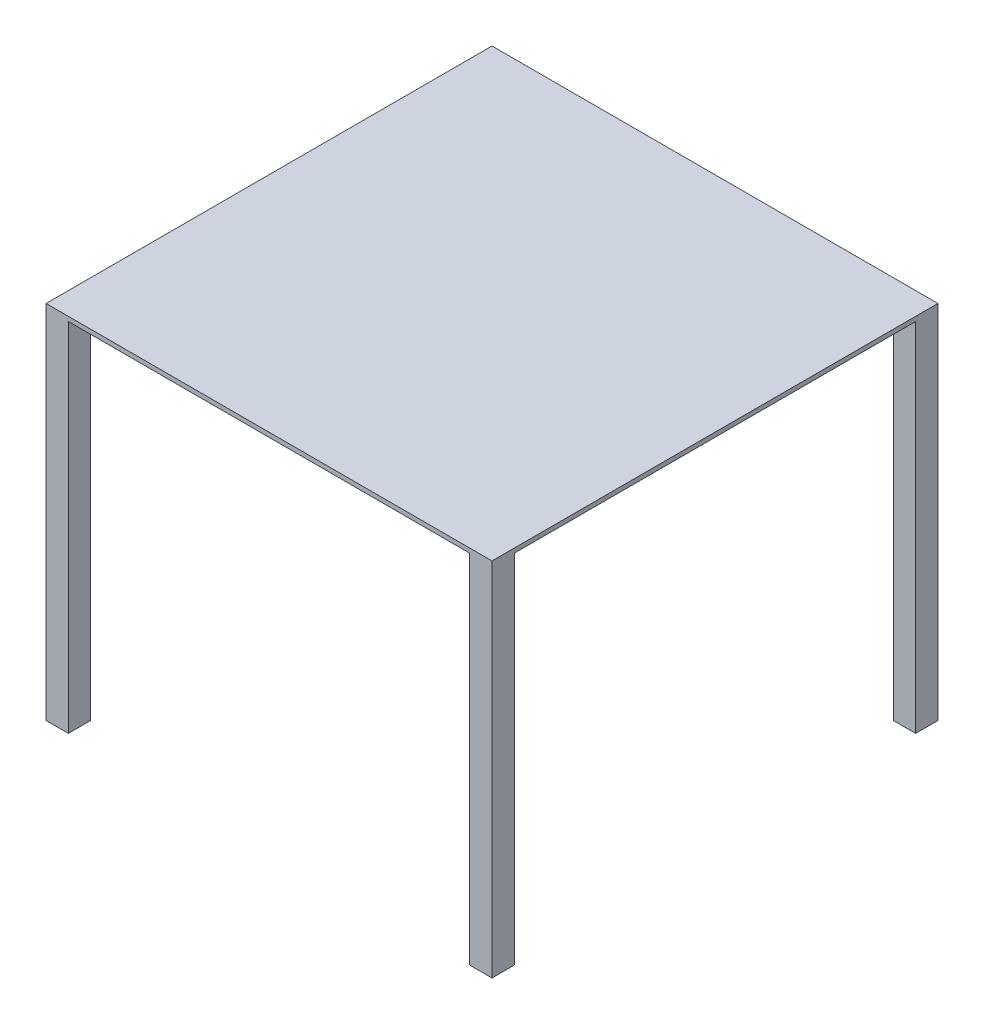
ISO-10303-21;
HEADER;
FILE_DESCRIPTION(('STEP AP214'),'2;1');
FILE_NAME('part.step','',(''),(''),'','','');
FILE_SCHEMA(('AUTOMOTIVE_DESIGN { 1 0 10303 214 1 1 1 1 }'));
ENDSEC;
DATA;
#1=APPLICATION_CONTEXT('core data for automotive mechanical design processes');
#2=APPLICATION_PROTOCOL_DEFINITION('international standard','automotive_design',2000,#1);
#3=PRODUCT_CONTEXT('',#1,'mechanical');
#4=PRODUCT('Part','Part','',(#3));
#5=PRODUCT_RELATED_PRODUCT_CATEGORY('part','',(#4));
#6=PRODUCT_DEFINITION_FORMATION('','',#4);
#7=PRODUCT_DEFINITION_CONTEXT('part definition',#1,'design');
#8=PRODUCT_DEFINITION('design','',#6,#7);
#9=PRODUCT_DEFINITION_SHAPE('','',#8);
#10=(LENGTH_UNIT() NAMED_UNIT(*) SI_UNIT(.MILLI.,.METRE.));
#11=(NAMED_UNIT(*) PLANE_ANGLE_UNIT() SI_UNIT($,.RADIAN.));
#12=(NAMED_UNIT(*) SI_UNIT($,.STERADIAN.) SOLID_ANGLE_UNIT());
#13=UNCERTAINTY_MEASURE_WITH_UNIT(LENGTH_MEASURE(1.E-05),#10,'distance_accuracy_value','');
#14=(GEOMETRIC_REPRESENTATION_CONTEXT(3) GLOBAL_UNCERTAINTY_ASSIGNED_CONTEXT((#13)) GLOBAL_UNIT_ASSIGNED_CONTEXT((#10,
#11,#12)) REPRESENTATION_CONTEXT('',''));
#15=CARTESIAN_POINT('',(0.,0.,0.));
#16=DIRECTION('',(0.,0.,1.));
#17=DIRECTION('',(1.,0.,0.));
#18=AXIS2_PLACEMENT_3D('',#15,#16,#17);
#19=CARTESIAN_POINT('',(-125.502845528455,-11.4093495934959,1000.));
#20=DIRECTION('',(0.,1.,0.));
#21=DIRECTION('',(0.,0.,1.));
#22=AXIS2_PLACEMENT_3D('',#19,#20,#21);
#23=PLANE('',#22);
#24=DIRECTION('',(0.,0.,1.));
#25=VECTOR('',#24,1.);
#26=CARTESIAN_POINT('',(-75.5028455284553,-11.4093495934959,1000.));
#27=LINE('',#26,#25);
#28=CARTESIAN_POINT('',(-75.5028455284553,-11.4093495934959,950.));
#29=VERTEX_POINT('',#28);
#30=CARTESIAN_POINT('',(-75.5028455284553,-11.4093495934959,1000.));
#31=VERTEX_POINT('',#30);
#32=EDGE_CURVE('E42',#29,#31,#27,.T.);
#33=ORIENTED_EDGE('',*,*,#32,.F.);
#34=DIRECTION('',(1.,0.,0.));
#35=VECTOR('',#34,1.);
#36=CARTESIAN_POINT('',(-75.5028455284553,-11.4093495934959,950.));
#37=LINE('',#36,#35);
#38=CARTESIAN_POINT('',(-125.502845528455,-11.4093495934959,950.));
#39=VERTEX_POINT('',#38);
#40=EDGE_CURVE('E146',#39,#29,#37,.T.);
#41=ORIENTED_EDGE('',*,*,#40,.F.);
#42=DIRECTION('',(0.,0.,-1.));
#43=VECTOR('',#42,1.);
#44=CARTESIAN_POINT('',(-125.502845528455,-11.4093495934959,1000.));
#45=LINE('',#44,#43);
#46=CARTESIAN_POINT('',(-125.502845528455,-11.4093495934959,49.9999999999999));
#47=VERTEX_POINT('',#46);
#48=EDGE_CURVE('E11',#39,#47,#45,.T.);
#49=ORIENTED_EDGE('',*,*,#48,.T.);
#50=DIRECTION('',(-1.,0.,0.));
#51=VECTOR('',#50,1.);
#52=CARTESIAN_POINT('',(-75.5028455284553,-11.4093495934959,50.));
#53=LINE('',#52,#51);
#54=CARTESIAN_POINT('',(-75.5028455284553,-11.4093495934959,50.));
#55=VERTEX_POINT('',#54);
#56=EDGE_CURVE('E49',#55,#47,#53,.T.);
#57=ORIENTED_EDGE('',*,*,#56,.F.);
#58=DIRECTION('',(0.,0.,1.));
#59=VECTOR('',#58,1.);
#60=CARTESIAN_POINT('',(-75.5028455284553,-11.4093495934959,50.));
#61=LINE('',#60,#59);
#62=CARTESIAN_POINT('',(-75.5028455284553,-11.4093495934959,0.));
#63=VERTEX_POINT('',#62);
#64=EDGE_CURVE('E381',#63,#55,#61,.T.);
#65=ORIENTED_EDGE('',*,*,#64,.F.);
#66=DIRECTION('',(1.,0.,0.));
#67=VECTOR('',#66,1.);
#68=CARTESIAN_POINT('',(-125.502845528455,-11.4093495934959,0.));
#69=LINE('',#68,#67);
#70=CARTESIAN_POINT('',(824.497154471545,-11.4093495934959,0.));
#71=VERTEX_POINT('',#70);
#72=EDGE_CURVE('E232',#63,#71,#69,.T.);
#73=ORIENTED_EDGE('',*,*,#72,.T.);
#74=DIRECTION('',(0.,0.,-1.));
#75=VECTOR('',#74,1.);
#76=CARTESIAN_POINT('',(824.497154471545,-11.4093495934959,50.));
#77=LINE('',#76,#75);
#78=CARTESIAN_POINT('',(824.497154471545,-11.4093495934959,49.9999999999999));
#79=VERTEX_POINT('',#78);
#80=EDGE_CURVE('E176',#79,#71,#77,.T.);
#81=ORIENTED_EDGE('',*,*,#80,.F.);
#82=DIRECTION('',(-1.,0.,0.));
#83=VECTOR('',#82,1.);
#84=CARTESIAN_POINT('',(874.497154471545,-11.4093495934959,50.));
#85=LINE('',#84,#83);
#86=CARTESIAN_POINT('',(874.497154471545,-11.4093495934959,50.));
#87=VERTEX_POINT('',#86);
#88=EDGE_CURVE('E167',#87,#79,#85,.T.);
#89=ORIENTED_EDGE('',*,*,#88,.F.);
#90=DIRECTION('',(0.,0.,-1.));
#91=VECTOR('',#90,1.);
#92=CARTESIAN_POINT('',(874.497154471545,-11.4093495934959,1000.));
#93=LINE('',#92,#91);
#94=CARTESIAN_POINT('',(874.497154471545,-11.4093495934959,950.));
#95=VERTEX_POINT('',#94);
#96=EDGE_CURVE('E34',#95,#87,#93,.T.);
#97=ORIENTED_EDGE('',*,*,#96,.F.);
#98=DIRECTION('',(1.,0.,0.));
#99=VECTOR('',#98,1.);
#100=CARTESIAN_POINT('',(874.497154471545,-11.4093495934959,950.));
#101=LINE('',#100,#99);
#102=CARTESIAN_POINT('',(824.497154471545,-11.4093495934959,950.));
#103=VERTEX_POINT('',#102);
#104=EDGE_CURVE('E204',#103,#95,#101,.T.);
#105=ORIENTED_EDGE('',*,*,#104,.F.);
#106=DIRECTION('',(0.,0.,-1.));
#107=VECTOR('',#106,1.);
#108=CARTESIAN_POINT('',(824.497154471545,-11.4093495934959,1000.));
#109=LINE('',#108,#107);
#110=CARTESIAN_POINT('',(824.497154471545,-11.4093495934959,1000.));
#111=VERTEX_POINT('',#110);
#112=EDGE_CURVE('E198',#111,#103,#109,.T.);
#113=ORIENTED_EDGE('',*,*,#112,.F.);
#114=DIRECTION('',(1.,0.,0.));
#115=VECTOR('',#114,1.);
#116=CARTESIAN_POINT('',(-125.502845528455,-11.4093495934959,1000.));
#117=LINE('',#116,#115);
#118=EDGE_CURVE('E28',#31,#111,#117,.T.);
#119=ORIENTED_EDGE('',*,*,#118,.F.);
#120=EDGE_LOOP('',(#33,#41,#49,#57,#65,#73,#81,#89,#97,#105,#113,#119));
#121=FACE_BOUND('',#120,.T.);
#122=ADVANCED_FACE('F24',(#121),#23,.F.);
#123=CARTESIAN_POINT('',(-125.502845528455,-1.40934959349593,1000.));
#124=DIRECTION('',(1.,0.,0.));
#125=DIRECTION('',(0.,0.,-1.));
#126=AXIS2_PLACEMENT_3D('',#123,#124,#125);
#127=PLANE('',#126);
#128=DIRECTION('',(0.,-1.,0.));
#129=VECTOR('',#128,1.);
#130=CARTESIAN_POINT('',(-125.502845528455,-1.40934959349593,0.));
#131=LINE('',#130,#129);
#132=CARTESIAN_POINT('',(-125.502845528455,-1.40934959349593,0.));
#133=VERTEX_POINT('',#132);
#134=CARTESIAN_POINT('',(-125.502845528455,-811.409349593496,0.));
#135=VERTEX_POINT('',#134);
#136=EDGE_CURVE('E230',#133,#135,#131,.T.);
#137=ORIENTED_EDGE('',*,*,#136,.T.);
#138=DIRECTION('',(0.,0.,-1.));
#139=VECTOR('',#138,1.);
#140=CARTESIAN_POINT('',(-125.502845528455,-811.409349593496,50.));
#141=LINE('',#140,#139);
#142=CARTESIAN_POINT('',(-125.502845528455,-811.409349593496,50.));
#143=VERTEX_POINT('',#142);
#144=EDGE_CURVE('E162',#143,#135,#141,.T.);
#145=ORIENTED_EDGE('',*,*,#144,.F.);
#146=DIRECTION('',(0.,1.,0.));
#147=VECTOR('',#146,1.);
#148=CARTESIAN_POINT('',(-125.502845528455,-811.409349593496,50.));
#149=LINE('',#148,#147);
#150=EDGE_CURVE('E160',#143,#47,#149,.T.);
#151=ORIENTED_EDGE('',*,*,#150,.T.);
#152=ORIENTED_EDGE('',*,*,#48,.F.);
#153=DIRECTION('',(0.,1.,0.));
#154=VECTOR('',#153,1.);
#155=CARTESIAN_POINT('',(-125.502845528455,-811.409349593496,950.));
#156=LINE('',#155,#154);
#157=CARTESIAN_POINT('',(-125.502845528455,-811.409349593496,950.));
#158=VERTEX_POINT('',#157);
#159=EDGE_CURVE('E142',#158,#39,#156,.T.);
#160=ORIENTED_EDGE('',*,*,#159,.F.);
#161=DIRECTION('',(0.,0.,-1.));
#162=VECTOR('',#161,1.);
#163=CARTESIAN_POINT('',(-125.502845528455,-811.409349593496,1000.));
#164=LINE('',#163,#162);
#165=CARTESIAN_POINT('',(-125.502845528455,-811.409349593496,1000.));
#166=VERTEX_POINT('',#165);
#167=EDGE_CURVE('E408',#166,#158,#164,.T.);
#168=ORIENTED_EDGE('',*,*,#167,.F.);
#169=DIRECTION('',(0.,-1.,0.));
#170=VECTOR('',#169,1.);
#171=CARTESIAN_POINT('',(-125.502845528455,-1.40934959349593,1000.));
#172=LINE('',#171,#170);
#173=CARTESIAN_POINT('',(-125.502845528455,-1.40934959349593,1000.));
#174=VERTEX_POINT('',#173);
#175=EDGE_CURVE('E238',#174,#166,#172,.T.);
#176=ORIENTED_EDGE('',*,*,#175,.F.);
#177=DIRECTION('',(0.,0.,-1.));
#178=VECTOR('',#177,1.);
#179=CARTESIAN_POINT('',(-125.502845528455,-1.40934959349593,1000.));
#180=LINE('',#179,#178);
#181=EDGE_CURVE('E245',#174,#133,#180,.T.);
#182=ORIENTED_EDGE('',*,*,#181,.T.);
#183=EDGE_LOOP('',(#137,#145,#151,#152,#160,#168,#176,#182));
#184=FACE_BOUND('',#183,.T.);
#185=ADVANCED_FACE('F26',(#184),#127,.F.);
#186=CARTESIAN_POINT('',(874.497154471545,-1.40934959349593,1000.));
#187=DIRECTION('',(-1.,0.,0.));
#188=DIRECTION('',(0.,0.,1.));
#189=AXIS2_PLACEMENT_3D('',#186,#187,#188);
#190=PLANE('',#189);
#191=DIRECTION('',(0.,1.,0.));
#192=VECTOR('',#191,1.);
#193=CARTESIAN_POINT('',(874.497154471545,-1.40934959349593,0.));
#194=LINE('',#193,#192);
#195=CARTESIAN_POINT('',(874.497154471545,-811.409349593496,0.));
#196=VERTEX_POINT('',#195);
#197=CARTESIAN_POINT('',(874.497154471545,-1.40934959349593,0.));
#198=VERTEX_POINT('',#197);
#199=EDGE_CURVE('E234',#196,#198,#194,.T.);
#200=ORIENTED_EDGE('',*,*,#199,.T.);
#201=DIRECTION('',(0.,0.,-1.));
#202=VECTOR('',#201,1.);
#203=CARTESIAN_POINT('',(874.497154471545,-1.40934959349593,1000.));
#204=LINE('',#203,#202);
#205=CARTESIAN_POINT('',(874.497154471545,-1.40934959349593,1000.));
#206=VERTEX_POINT('',#205);
#207=EDGE_CURVE('E248',#206,#198,#204,.T.);
#208=ORIENTED_EDGE('',*,*,#207,.F.);
#209=DIRECTION('',(0.,1.,0.));
#210=VECTOR('',#209,1.);
#211=CARTESIAN_POINT('',(874.497154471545,-1.40934959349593,1000.));
#212=LINE('',#211,#210);
#213=CARTESIAN_POINT('',(874.497154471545,-811.409349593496,1000.));
#214=VERTEX_POINT('',#213);
#215=EDGE_CURVE('E241',#214,#206,#212,.T.);
#216=ORIENTED_EDGE('',*,*,#215,.F.);
#217=DIRECTION('',(0.,0.,1.));
#218=VECTOR('',#217,1.);
#219=CARTESIAN_POINT('',(874.497154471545,-811.409349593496,1000.));
#220=LINE('',#219,#218);
#221=CARTESIAN_POINT('',(874.497154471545,-811.409349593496,950.));
#222=VERTEX_POINT('',#221);
#223=EDGE_CURVE('E201',#222,#214,#220,.T.);
#224=ORIENTED_EDGE('',*,*,#223,.F.);
#225=DIRECTION('',(0.,1.,0.));
#226=VECTOR('',#225,1.);
#227=CARTESIAN_POINT('',(874.497154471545,-811.409349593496,950.));
#228=LINE('',#227,#226);
#229=EDGE_CURVE('E210',#222,#95,#228,.T.);
#230=ORIENTED_EDGE('',*,*,#229,.T.);
#231=ORIENTED_EDGE('',*,*,#96,.T.);
#232=DIRECTION('',(0.,1.,0.));
#233=VECTOR('',#232,1.);
#234=CARTESIAN_POINT('',(874.497154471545,-811.409349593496,50.));
#235=LINE('',#234,#233);
#236=CARTESIAN_POINT('',(874.497154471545,-811.409349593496,50.));
#237=VERTEX_POINT('',#236);
#238=EDGE_CURVE('E195',#237,#87,#235,.T.);
#239=ORIENTED_EDGE('',*,*,#238,.F.);
#240=DIRECTION('',(0.,0.,1.));
#241=VECTOR('',#240,1.);
#242=CARTESIAN_POINT('',(874.497154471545,-811.409349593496,50.));
#243=LINE('',#242,#241);
#244=EDGE_CURVE('E179',#196,#237,#243,.T.);
#245=ORIENTED_EDGE('',*,*,#244,.F.);
#246=EDGE_LOOP('',(#200,#208,#216,#224,#230,#231,#239,#245));
#247=FACE_BOUND('',#246,.T.);
#248=ADVANCED_FACE('F269',(#247),#190,.F.);
#249=CARTESIAN_POINT('',(-125.502845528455,-1.40934959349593,1000.));
#250=DIRECTION('',(0.,-1.,0.));
#251=DIRECTION('',(0.,0.,-1.));
#252=AXIS2_PLACEMENT_3D('',#249,#250,#251);
#253=PLANE('',#252);
#254=DIRECTION('',(-1.,0.,0.));
#255=VECTOR('',#254,1.);
#256=CARTESIAN_POINT('',(-125.502845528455,-1.40934959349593,0.));
#257=LINE('',#256,#255);
#258=EDGE_CURVE('E236',#198,#133,#257,.T.);
#259=ORIENTED_EDGE('',*,*,#258,.T.);
#260=ORIENTED_EDGE('',*,*,#181,.F.);
#261=DIRECTION('',(-1.,0.,0.));
#262=VECTOR('',#261,1.);
#263=CARTESIAN_POINT('',(-125.502845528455,-1.40934959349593,1000.));
#264=LINE('',#263,#262);
#265=EDGE_CURVE('E243',#206,#174,#264,.T.);
#266=ORIENTED_EDGE('',*,*,#265,.F.);
#267=ORIENTED_EDGE('',*,*,#207,.T.);
#268=EDGE_LOOP('',(#259,#260,#266,#267));
#269=FACE_BOUND('',#268,.T.);
#270=ADVANCED_FACE('F290',(#269),#253,.F.);
#271=CARTESIAN_POINT('',(-125.502845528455,-11.4093495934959,1000.));
#272=DIRECTION('',(0.,0.,1.));
#273=DIRECTION('',(1.,0.,0.));
#274=AXIS2_PLACEMENT_3D('',#271,#272,#273);
#275=PLANE('',#274);
#276=ORIENTED_EDGE('',*,*,#175,.T.);
#277=DIRECTION('',(-1.,0.,0.));
#278=VECTOR('',#277,1.);
#279=CARTESIAN_POINT('',(-75.5028455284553,-811.409349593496,1000.));
#280=LINE('',#279,#278);
#281=CARTESIAN_POINT('',(-75.5028455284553,-811.409349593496,1000.));
#282=VERTEX_POINT('',#281);
#283=EDGE_CURVE('E379',#282,#166,#280,.T.);
#284=ORIENTED_EDGE('',*,*,#283,.F.);
#285=DIRECTION('',(0.,1.,0.));
#286=VECTOR('',#285,1.);
#287=CARTESIAN_POINT('',(-75.5028455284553,-811.409349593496,1000.));
#288=LINE('',#287,#286);
#289=EDGE_CURVE('E151',#282,#31,#288,.T.);
#290=ORIENTED_EDGE('',*,*,#289,.T.);
#291=ORIENTED_EDGE('',*,*,#118,.T.);
#292=DIRECTION('',(0.,1.,0.));
#293=VECTOR('',#292,1.);
#294=CARTESIAN_POINT('',(824.497154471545,-811.409349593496,1000.));
#295=LINE('',#294,#293);
#296=CARTESIAN_POINT('',(824.497154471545,-811.409349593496,1000.));
#297=VERTEX_POINT('',#296);
#298=EDGE_CURVE('E220',#297,#111,#295,.T.);
#299=ORIENTED_EDGE('',*,*,#298,.F.);
#300=DIRECTION('',(-1.,0.,0.));
#301=VECTOR('',#300,1.);
#302=CARTESIAN_POINT('',(874.497154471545,-811.409349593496,1000.));
#303=LINE('',#302,#301);
#304=EDGE_CURVE('E227',#214,#297,#303,.T.);
#305=ORIENTED_EDGE('',*,*,#304,.F.);
#306=ORIENTED_EDGE('',*,*,#215,.T.);
#307=ORIENTED_EDGE('',*,*,#265,.T.);
#308=EDGE_LOOP('',(#276,#284,#290,#291,#299,#305,#306,#307));
#309=FACE_BOUND('',#308,.T.);
#310=ADVANCED_FACE('F266',(#309),#275,.T.);
#311=CARTESIAN_POINT('',(-125.502845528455,-11.4093495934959,0.));
#312=DIRECTION('',(0.,0.,1.));
#313=DIRECTION('',(1.,0.,0.));
#314=AXIS2_PLACEMENT_3D('',#311,#312,#313);
#315=PLANE('',#314);
#316=ORIENTED_EDGE('',*,*,#136,.F.);
#317=ORIENTED_EDGE('',*,*,#258,.F.);
#318=ORIENTED_EDGE('',*,*,#199,.F.);
#319=DIRECTION('',(1.,0.,0.));
#320=VECTOR('',#319,1.);
#321=CARTESIAN_POINT('',(874.497154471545,-811.409349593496,0.));
#322=LINE('',#321,#320);
#323=CARTESIAN_POINT('',(824.497154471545,-811.409349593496,0.));
#324=VERTEX_POINT('',#323);
#325=EDGE_CURVE('E186',#324,#196,#322,.T.);
#326=ORIENTED_EDGE('',*,*,#325,.F.);
#327=DIRECTION('',(0.,1.,0.));
#328=VECTOR('',#327,1.);
#329=CARTESIAN_POINT('',(824.497154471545,-811.409349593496,0.));
#330=LINE('',#329,#328);
#331=EDGE_CURVE('E189',#324,#71,#330,.T.);
#332=ORIENTED_EDGE('',*,*,#331,.T.);
#333=ORIENTED_EDGE('',*,*,#72,.F.);
#334=DIRECTION('',(0.,1.,0.));
#335=VECTOR('',#334,1.);
#336=CARTESIAN_POINT('',(-75.5028455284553,-811.409349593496,0.));
#337=LINE('',#336,#335);
#338=CARTESIAN_POINT('',(-75.5028455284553,-811.409349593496,0.));
#339=VERTEX_POINT('',#338);
#340=EDGE_CURVE('E165',#339,#63,#337,.T.);
#341=ORIENTED_EDGE('',*,*,#340,.F.);
#342=DIRECTION('',(1.,0.,0.));
#343=VECTOR('',#342,1.);
#344=CARTESIAN_POINT('',(-75.5028455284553,-811.409349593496,0.));
#345=LINE('',#344,#343);
#346=EDGE_CURVE('E170',#135,#339,#345,.T.);
#347=ORIENTED_EDGE('',*,*,#346,.F.);
#348=EDGE_LOOP('',(#316,#317,#318,#326,#332,#333,#341,#347));
#349=FACE_BOUND('',#348,.T.);
#350=ADVANCED_FACE('F296',(#349),#315,.F.);
#351=CARTESIAN_POINT('',(824.497154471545,-811.409349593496,1000.));
#352=DIRECTION('',(1.,0.,0.));
#353=DIRECTION('',(0.,0.,-1.));
#354=AXIS2_PLACEMENT_3D('',#351,#352,#353);
#355=PLANE('',#354);
#356=ORIENTED_EDGE('',*,*,#112,.T.);
#357=DIRECTION('',(0.,1.,0.));
#358=VECTOR('',#357,1.);
#359=CARTESIAN_POINT('',(824.497154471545,-811.409349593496,950.));
#360=LINE('',#359,#358);
#361=CARTESIAN_POINT('',(824.497154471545,-811.409349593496,950.));
#362=VERTEX_POINT('',#361);
#363=EDGE_CURVE('E212',#362,#103,#360,.T.);
#364=ORIENTED_EDGE('',*,*,#363,.F.);
#365=DIRECTION('',(0.,0.,-1.));
#366=VECTOR('',#365,1.);
#367=CARTESIAN_POINT('',(824.497154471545,-811.409349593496,1000.));
#368=LINE('',#367,#366);
#369=EDGE_CURVE('E222',#297,#362,#368,.T.);
#370=ORIENTED_EDGE('',*,*,#369,.F.);
#371=ORIENTED_EDGE('',*,*,#298,.T.);
#372=EDGE_LOOP('',(#356,#364,#370,#371));
#373=FACE_BOUND('',#372,.T.);
#374=ADVANCED_FACE('F261',(#373),#355,.F.);
#375=CARTESIAN_POINT('',(874.497154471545,-811.409349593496,950.));
#376=DIRECTION('',(0.,0.,1.));
#377=DIRECTION('',(1.,0.,0.));
#378=AXIS2_PLACEMENT_3D('',#375,#376,#377);
#379=PLANE('',#378);
#380=ORIENTED_EDGE('',*,*,#104,.T.);
#381=ORIENTED_EDGE('',*,*,#229,.F.);
#382=DIRECTION('',(1.,0.,0.));
#383=VECTOR('',#382,1.);
#384=CARTESIAN_POINT('',(874.497154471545,-811.409349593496,950.));
#385=LINE('',#384,#383);
#386=EDGE_CURVE('E213',#362,#222,#385,.T.);
#387=ORIENTED_EDGE('',*,*,#386,.F.);
#388=ORIENTED_EDGE('',*,*,#363,.T.);
#389=EDGE_LOOP('',(#380,#381,#387,#388));
#390=FACE_BOUND('',#389,.T.);
#391=ADVANCED_FACE('F268',(#390),#379,.F.);
#392=CARTESIAN_POINT('',(874.497154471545,-811.409349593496,950.));
#393=DIRECTION('',(0.,1.,0.));
#394=DIRECTION('',(0.,0.,1.));
#395=AXIS2_PLACEMENT_3D('',#392,#393,#394);
#396=PLANE('',#395);
#397=ORIENTED_EDGE('',*,*,#223,.T.);
#398=ORIENTED_EDGE('',*,*,#304,.T.);
#399=ORIENTED_EDGE('',*,*,#369,.T.);
#400=ORIENTED_EDGE('',*,*,#386,.T.);
#401=EDGE_LOOP('',(#397,#398,#399,#400));
#402=FACE_BOUND('',#401,.T.);
#403=ADVANCED_FACE('F271',(#402),#396,.F.);
#404=CARTESIAN_POINT('',(874.497154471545,-811.409349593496,50.));
#405=DIRECTION('',(0.,0.,-1.));
#406=DIRECTION('',(-1.,0.,0.));
#407=AXIS2_PLACEMENT_3D('',#404,#405,#406);
#408=PLANE('',#407);
#409=ORIENTED_EDGE('',*,*,#88,.T.);
#410=DIRECTION('',(0.,1.,0.));
#411=VECTOR('',#410,1.);
#412=CARTESIAN_POINT('',(824.497154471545,-811.409349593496,50.));
#413=LINE('',#412,#411);
#414=CARTESIAN_POINT('',(824.497154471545,-811.409349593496,50.));
#415=VERTEX_POINT('',#414);
#416=EDGE_CURVE('E192',#415,#79,#413,.T.);
#417=ORIENTED_EDGE('',*,*,#416,.F.);
#418=DIRECTION('',(-1.,0.,0.));
#419=VECTOR('',#418,1.);
#420=CARTESIAN_POINT('',(874.497154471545,-811.409349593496,50.));
#421=LINE('',#420,#419);
#422=EDGE_CURVE('E182',#237,#415,#421,.T.);
#423=ORIENTED_EDGE('',*,*,#422,.F.);
#424=ORIENTED_EDGE('',*,*,#238,.T.);
#425=EDGE_LOOP('',(#409,#417,#423,#424));
#426=FACE_BOUND('',#425,.T.);
#427=ADVANCED_FACE('F273',(#426),#408,.F.);
#428=CARTESIAN_POINT('',(824.497154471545,-811.409349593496,50.));
#429=DIRECTION('',(1.,0.,0.));
#430=DIRECTION('',(0.,0.,-1.));
#431=AXIS2_PLACEMENT_3D('',#428,#429,#430);
#432=PLANE('',#431);
#433=ORIENTED_EDGE('',*,*,#80,.T.);
#434=ORIENTED_EDGE('',*,*,#331,.F.);
#435=DIRECTION('',(0.,0.,-1.));
#436=VECTOR('',#435,1.);
#437=CARTESIAN_POINT('',(824.497154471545,-811.409349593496,50.));
#438=LINE('',#437,#436);
#439=EDGE_CURVE('E184',#415,#324,#438,.T.);
#440=ORIENTED_EDGE('',*,*,#439,.F.);
#441=ORIENTED_EDGE('',*,*,#416,.T.);
#442=EDGE_LOOP('',(#433,#434,#440,#441));
#443=FACE_BOUND('',#442,.T.);
#444=ADVANCED_FACE('F279',(#443),#432,.F.);
#445=CARTESIAN_POINT('',(874.497154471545,-811.409349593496,0.));
#446=DIRECTION('',(0.,1.,0.));
#447=DIRECTION('',(0.,0.,1.));
#448=AXIS2_PLACEMENT_3D('',#445,#446,#447);
#449=PLANE('',#448);
#450=ORIENTED_EDGE('',*,*,#244,.T.);
#451=ORIENTED_EDGE('',*,*,#422,.T.);
#452=ORIENTED_EDGE('',*,*,#439,.T.);
#453=ORIENTED_EDGE('',*,*,#325,.T.);
#454=EDGE_LOOP('',(#450,#451,#452,#453));
#455=FACE_BOUND('',#454,.T.);
#456=ADVANCED_FACE('F322',(#455),#449,.F.);
#457=CARTESIAN_POINT('',(-75.5028455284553,-811.409349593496,50.));
#458=DIRECTION('',(-1.,0.,0.));
#459=DIRECTION('',(0.,0.,1.));
#460=AXIS2_PLACEMENT_3D('',#457,#458,#459);
#461=PLANE('',#460);
#462=ORIENTED_EDGE('',*,*,#64,.T.);
#463=DIRECTION('',(0.,1.,0.));
#464=VECTOR('',#463,1.);
#465=CARTESIAN_POINT('',(-75.5028455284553,-811.409349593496,50.));
#466=LINE('',#465,#464);
#467=CARTESIAN_POINT('',(-75.5028455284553,-811.409349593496,50.));
#468=VERTEX_POINT('',#467);
#469=EDGE_CURVE('E164',#468,#55,#466,.T.);
#470=ORIENTED_EDGE('',*,*,#469,.F.);
#471=DIRECTION('',(0.,0.,1.));
#472=VECTOR('',#471,1.);
#473=CARTESIAN_POINT('',(-75.5028455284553,-811.409349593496,50.));
#474=LINE('',#473,#472);
#475=EDGE_CURVE('E388',#339,#468,#474,.T.);
#476=ORIENTED_EDGE('',*,*,#475,.F.);
#477=ORIENTED_EDGE('',*,*,#340,.T.);
#478=EDGE_LOOP('',(#462,#470,#476,#477));
#479=FACE_BOUND('',#478,.T.);
#480=ADVANCED_FACE('F330',(#479),#461,.F.);
#481=CARTESIAN_POINT('',(-75.5028455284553,-811.409349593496,50.));
#482=DIRECTION('',(0.,0.,-1.));
#483=DIRECTION('',(-1.,0.,0.));
#484=AXIS2_PLACEMENT_3D('',#481,#482,#483);
#485=PLANE('',#484);
#486=ORIENTED_EDGE('',*,*,#56,.T.);
#487=ORIENTED_EDGE('',*,*,#150,.F.);
#488=DIRECTION('',(-1.,0.,0.));
#489=VECTOR('',#488,1.);
#490=CARTESIAN_POINT('',(-75.5028455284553,-811.409349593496,50.));
#491=LINE('',#490,#489);
#492=EDGE_CURVE('E391',#468,#143,#491,.T.);
#493=ORIENTED_EDGE('',*,*,#492,.F.);
#494=ORIENTED_EDGE('',*,*,#469,.T.);
#495=EDGE_LOOP('',(#486,#487,#493,#494));
#496=FACE_BOUND('',#495,.T.);
#497=ADVANCED_FACE('F338',(#496),#485,.F.);
#498=CARTESIAN_POINT('',(-75.5028455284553,-811.409349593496,0.));
#499=DIRECTION('',(0.,1.,0.));
#500=DIRECTION('',(0.,0.,1.));
#501=AXIS2_PLACEMENT_3D('',#498,#499,#500);
#502=PLANE('',#501);
#503=ORIENTED_EDGE('',*,*,#475,.T.);
#504=ORIENTED_EDGE('',*,*,#492,.T.);
#505=ORIENTED_EDGE('',*,*,#144,.T.);
#506=ORIENTED_EDGE('',*,*,#346,.T.);
#507=EDGE_LOOP('',(#503,#504,#505,#506));
#508=FACE_BOUND('',#507,.T.);
#509=ADVANCED_FACE('F346',(#508),#502,.F.);
#510=CARTESIAN_POINT('',(-75.5028455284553,-811.409349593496,1000.));
#511=DIRECTION('',(-1.,0.,0.));
#512=DIRECTION('',(0.,0.,1.));
#513=AXIS2_PLACEMENT_3D('',#510,#511,#512);
#514=PLANE('',#513);
#515=ORIENTED_EDGE('',*,*,#32,.T.);
#516=ORIENTED_EDGE('',*,*,#289,.F.);
#517=DIRECTION('',(0.,0.,1.));
#518=VECTOR('',#517,1.);
#519=CARTESIAN_POINT('',(-75.5028455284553,-811.409349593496,1000.));
#520=LINE('',#519,#518);
#521=CARTESIAN_POINT('',(-75.5028455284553,-811.409349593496,950.));
#522=VERTEX_POINT('',#521);
#523=EDGE_CURVE('E155',#522,#282,#520,.T.);
#524=ORIENTED_EDGE('',*,*,#523,.F.);
#525=DIRECTION('',(0.,1.,0.));
#526=VECTOR('',#525,1.);
#527=CARTESIAN_POINT('',(-75.5028455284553,-811.409349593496,950.));
#528=LINE('',#527,#526);
#529=EDGE_CURVE('E152',#522,#29,#528,.T.);
#530=ORIENTED_EDGE('',*,*,#529,.T.);
#531=EDGE_LOOP('',(#515,#516,#524,#530));
#532=FACE_BOUND('',#531,.T.);
#533=ADVANCED_FACE('F353',(#532),#514,.F.);
#534=CARTESIAN_POINT('',(-75.5028455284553,-811.409349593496,950.));
#535=DIRECTION('',(0.,0.,1.));
#536=DIRECTION('',(1.,0.,0.));
#537=AXIS2_PLACEMENT_3D('',#534,#535,#536);
#538=PLANE('',#537);
#539=ORIENTED_EDGE('',*,*,#40,.T.);
#540=ORIENTED_EDGE('',*,*,#529,.F.);
#541=DIRECTION('',(1.,0.,0.));
#542=VECTOR('',#541,1.);
#543=CARTESIAN_POINT('',(-75.5028455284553,-811.409349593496,950.));
#544=LINE('',#543,#542);
#545=EDGE_CURVE('E147',#158,#522,#544,.T.);
#546=ORIENTED_EDGE('',*,*,#545,.F.);
#547=ORIENTED_EDGE('',*,*,#159,.T.);
#548=EDGE_LOOP('',(#539,#540,#546,#547));
#549=FACE_BOUND('',#548,.T.);
#550=ADVANCED_FACE('F144',(#549),#538,.F.);
#551=CARTESIAN_POINT('',(-75.5028455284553,-811.409349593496,950.));
#552=DIRECTION('',(0.,1.,0.));
#553=DIRECTION('',(0.,0.,1.));
#554=AXIS2_PLACEMENT_3D('',#551,#552,#553);
#555=PLANE('',#554);
#556=ORIENTED_EDGE('',*,*,#523,.T.);
#557=ORIENTED_EDGE('',*,*,#283,.T.);
#558=ORIENTED_EDGE('',*,*,#167,.T.);
#559=ORIENTED_EDGE('',*,*,#545,.T.);
#560=EDGE_LOOP('',(#556,#557,#558,#559));
#561=FACE_BOUND('',#560,.T.);
#562=ADVANCED_FACE('F367',(#561),#555,.F.);
#563=CLOSED_SHELL('',(#122,#185,#248,#270,#310,#350,#374,#391,#403,#427,#444,#456,#480,#497,
#509,#533,#550,#562));
#564=MANIFOLD_SOLID_BREP('B2',#563);
#565=ADVANCED_BREP_SHAPE_REPRESENTATION('',(#18,#564),#14);
#566=SHAPE_DEFINITION_REPRESENTATION(#9,#565);
ENDSEC;
END-ISO-10303-21;
